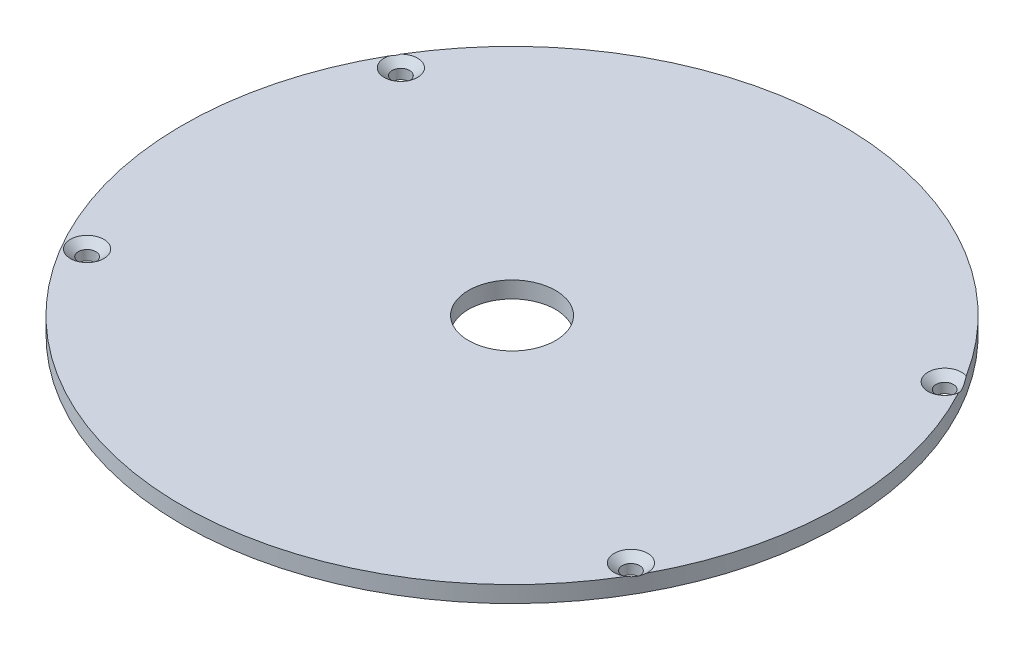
ISO-10303-21;
HEADER;
FILE_DESCRIPTION(('STEP AP214'),'2;1');
FILE_NAME('part.step','',(''),(''),'','','');
FILE_SCHEMA(('AUTOMOTIVE_DESIGN { 1 0 10303 214 1 1 1 1 }'));
ENDSEC;
DATA;
#1=APPLICATION_CONTEXT('core data for automotive mechanical design processes');
#2=APPLICATION_PROTOCOL_DEFINITION('international standard','automotive_design',2000,#1);
#3=PRODUCT_CONTEXT('',#1,'mechanical');
#4=PRODUCT('Part','Part','',(#3));
#5=PRODUCT_RELATED_PRODUCT_CATEGORY('part','',(#4));
#6=PRODUCT_DEFINITION_FORMATION('','',#4);
#7=PRODUCT_DEFINITION_CONTEXT('part definition',#1,'design');
#8=PRODUCT_DEFINITION('design','',#6,#7);
#9=PRODUCT_DEFINITION_SHAPE('','',#8);
#10=(LENGTH_UNIT() NAMED_UNIT(*) SI_UNIT(.MILLI.,.METRE.));
#11=(NAMED_UNIT(*) PLANE_ANGLE_UNIT() SI_UNIT($,.RADIAN.));
#12=(NAMED_UNIT(*) SI_UNIT($,.STERADIAN.) SOLID_ANGLE_UNIT());
#13=UNCERTAINTY_MEASURE_WITH_UNIT(LENGTH_MEASURE(1.E-05),#10,'distance_accuracy_value','');
#14=(GEOMETRIC_REPRESENTATION_CONTEXT(3) GLOBAL_UNCERTAINTY_ASSIGNED_CONTEXT((#13)) GLOBAL_UNIT_ASSIGNED_CONTEXT((#10,
#11,#12)) REPRESENTATION_CONTEXT('',''));
#15=CARTESIAN_POINT('',(0.,0.,0.));
#16=DIRECTION('',(0.,0.,1.));
#17=DIRECTION('',(1.,0.,0.));
#18=AXIS2_PLACEMENT_3D('',#15,#16,#17);
#19=CARTESIAN_POINT('',(0.,6.35,0.));
#20=DIRECTION('',(0.,-1.,0.));
#21=DIRECTION('',(0.,0.,-1.));
#22=AXIS2_PLACEMENT_3D('',#19,#20,#21);
#23=CYLINDRICAL_SURFACE('',#22,127.);
#24=CARTESIAN_POINT('',(0.,6.35,0.));
#25=DIRECTION('',(0.,1.,0.));
#26=DIRECTION('',(0.,0.,1.));
#27=AXIS2_PLACEMENT_3D('',#24,#25,#26);
#28=CIRCLE('',#27,127.);
#29=CARTESIAN_POINT('',(107.720673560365,6.35,-67.2700266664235));
#30=VERTEX_POINT('',#29);
#31=CARTESIAN_POINT('',(-108.671576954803,6.35,-65.7228146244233));
#32=VERTEX_POINT('',#31);
#33=EDGE_CURVE('E73',#30,#32,#28,.T.);
#34=ORIENTED_EDGE('',*,*,#33,.F.);
#35=CARTESIAN_POINT('',(107.720467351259,6.3502,-67.2703568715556));
#36=CARTESIAN_POINT('',(107.793697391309,6.27919614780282,-67.1530920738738));
#37=CARTESIAN_POINT('',(107.86720666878,6.20987681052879,-67.03495595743));
#38=CARTESIAN_POINT('',(108.0149114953,6.07531610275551,-66.7966959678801));
#39=CARTESIAN_POINT('',(108.089107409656,6.01007706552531,-66.6765710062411));
#40=CARTESIAN_POINT('',(108.23885018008,5.88394610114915,-66.4332136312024));
#41=CARTESIAN_POINT('',(108.314403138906,5.82309480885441,-66.3099636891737));
#42=CARTESIAN_POINT('',(108.466283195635,5.70731629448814,-66.0612342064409));
#43=CARTESIAN_POINT('',(108.542610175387,5.65238818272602,-65.9357550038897));
#44=CARTESIAN_POINT('',(108.769728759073,5.50019700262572,-65.5608890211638));
#45=CARTESIAN_POINT('',(108.921778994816,5.4128129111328,-65.3080050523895));
#46=CARTESIAN_POINT('',(109.151439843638,5.30898170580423,-64.922919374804));
#47=CARTESIAN_POINT('',(109.22814508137,5.27893610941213,-64.7937893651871));
#48=CARTESIAN_POINT('',(109.381933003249,5.22889555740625,-64.5338324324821));
#49=CARTESIAN_POINT('',(109.459015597,5.20889830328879,-64.4030059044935));
#50=CARTESIAN_POINT('',(109.639582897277,5.17483285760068,-64.0952696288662));
#51=CARTESIAN_POINT('',(109.743099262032,5.16511792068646,-63.9178716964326));
#52=CARTESIAN_POINT('',(109.949281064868,5.16611584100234,-63.5625504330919));
#53=CARTESIAN_POINT('',(110.051946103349,5.17683780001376,-63.3846269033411));
#54=CARTESIAN_POINT('',(110.255598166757,5.21787853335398,-63.0297153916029));
#55=CARTESIAN_POINT('',(110.356581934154,5.24823163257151,-62.8527295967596));
#56=CARTESIAN_POINT('',(110.55601384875,5.32636055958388,-62.5012692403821));
#57=CARTESIAN_POINT('',(110.654461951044,5.37413669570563,-62.3267947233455));
#58=CARTESIAN_POINT('',(110.847861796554,5.4839322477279,-61.9821775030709));
#59=CARTESIAN_POINT('',(110.942832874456,5.54585182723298,-61.8120133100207));
#60=CARTESIAN_POINT('',(111.130016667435,5.68142994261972,-61.4748452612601));
#61=CARTESIAN_POINT('',(111.22222836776,5.7550927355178,-61.3078425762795));
#62=CARTESIAN_POINT('',(111.403761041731,5.91155701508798,-60.9773521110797));
#63=CARTESIAN_POINT('',(111.493089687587,5.99433111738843,-60.8138554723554));
#64=CARTESIAN_POINT('',(111.625231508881,6.12398848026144,-60.5707534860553));
#65=CARTESIAN_POINT('',(111.668940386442,6.16809093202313,-60.4901321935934));
#66=CARTESIAN_POINT('',(111.755791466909,6.25795032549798,-60.3295234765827));
#67=CARTESIAN_POINT('',(111.79893373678,6.30370706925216,-60.249535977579));
#68=CARTESIAN_POINT('',(111.841812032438,6.3502,-60.1698353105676));
#69=B_SPLINE_CURVE_WITH_KNOTS('',3,(#35,#36,#37,#38,#39,#40,#41,#42,#43,#44,#45,#46,#47,#48,#49,
#50,#51,#52,#53,#54,#55,#56,#57,#58,#59,#60,#61,#62,#63,#64,#65,#66,#67,#68),.UNSPECIFIED.,.F.,
.F.,(4,2,2,2,2,2,2,2,2,2,2,2,2,2,2,2,4),(0.,0.466273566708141,0.932811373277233,
1.40322655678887,1.87357098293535,2.79469089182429,3.25391790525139,3.71303982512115,
4.32886642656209,4.94496735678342,5.56214845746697,6.17934048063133,6.79230357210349,
7.40548937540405,8.01688010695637,8.32214951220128,8.62738250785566),.UNSPECIFIED.);
#70=CARTESIAN_POINT('',(111.84162758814,6.35,-60.1701781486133));
#71=VERTEX_POINT('',#70);
#72=EDGE_CURVE('E46',#30,#71,#69,.T.);
#73=ORIENTED_EDGE('',*,*,#72,.T.);
#74=CARTESIAN_POINT('',(111.919864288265,6.35,60.0245281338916));
#75=VERTEX_POINT('',#74);
#76=EDGE_CURVE('E71',#75,#71,#28,.T.);
#77=ORIENTED_EDGE('',*,*,#76,.F.);
#78=CARTESIAN_POINT('',(111.920129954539,6.3502,60.0240327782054));
#79=CARTESIAN_POINT('',(111.860357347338,6.30520660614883,60.135483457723));
#80=CARTESIAN_POINT('',(111.800064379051,6.26235239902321,60.2475057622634));
#81=CARTESIAN_POINT('',(111.678382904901,6.18147231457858,60.472764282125));
#82=CARTESIAN_POINT('',(111.616993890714,6.143448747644,60.5860010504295));
#83=CARTESIAN_POINT('',(111.430853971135,6.03732172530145,60.9280904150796));
#84=CARTESIAN_POINT('',(111.304451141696,5.97740998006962,61.1587232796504));
#85=CARTESIAN_POINT('',(111.114403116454,5.90820430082,61.5028927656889));
#86=CARTESIAN_POINT('',(111.052153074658,5.88876386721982,61.6152246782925));
#87=CARTESIAN_POINT('',(110.926914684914,5.85642143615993,61.8404089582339));
#88=CARTESIAN_POINT('',(110.863926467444,5.84351830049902,61.9532612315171));
#89=CARTESIAN_POINT('',(110.737452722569,5.82456633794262,62.1790421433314));
#90=CARTESIAN_POINT('',(110.673968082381,5.81850726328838,62.2919704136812));
#91=CARTESIAN_POINT('',(110.546591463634,5.81334692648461,62.5177408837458));
#92=CARTESIAN_POINT('',(110.482699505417,5.81424531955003,62.6305830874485));
#93=CARTESIAN_POINT('',(110.310126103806,5.82604796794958,62.9342855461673));
#94=CARTESIAN_POINT('',(110.201214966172,5.84347981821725,63.1247954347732));
#95=CARTESIAN_POINT('',(109.983480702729,5.89723960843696,63.5033996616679));
#96=CARTESIAN_POINT('',(109.874657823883,5.93358935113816,63.6914909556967));
#97=CARTESIAN_POINT('',(109.654395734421,6.02443798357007,64.069984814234));
#98=CARTESIAN_POINT('',(109.542983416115,6.07947742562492,64.2602705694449));
#99=CARTESIAN_POINT('',(109.321627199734,6.20441012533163,64.6361305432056));
#100=CARTESIAN_POINT('',(109.211680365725,6.27426654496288,64.8217151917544));
#101=CARTESIAN_POINT('',(109.102482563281,6.35020000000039,65.0049867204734));
#102=B_SPLINE_CURVE_WITH_KNOTS('',3,(#78,#79,#80,#81,#82,#83,#84,#85,#86,#87,#88,#89,#90,#91,
#92,#93,#94,#95,#96,#97,#98,#99,#100,#101),.UNSPECIFIED.,.F.,.F.,(4,2,2,2,2,2,2,2,2,2,2,4),(0.,
0.402645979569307,0.805483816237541,1.61332352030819,2.00285991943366,2.39232847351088,
2.78121309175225,3.17007843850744,3.82953680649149,4.48975688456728,5.17097895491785,
5.85052681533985),.UNSPECIFIED.);
#103=CARTESIAN_POINT('',(109.102770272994,6.35,65.0045038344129));
#104=VERTEX_POINT('',#103);
#105=EDGE_CURVE('E41',#75,#104,#102,.T.);
#106=ORIENTED_EDGE('',*,*,#105,.T.);
#107=CARTESIAN_POINT('',(-110.227008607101,6.35,-63.0793672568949));
#108=VERTEX_POINT('',#107);
#109=EDGE_CURVE('E80',#108,#104,#28,.T.);
#110=ORIENTED_EDGE('',*,*,#109,.F.);
#111=CARTESIAN_POINT('',(-111.14340315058,6.89410090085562,-61.450337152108));
#112=CARTESIAN_POINT('',(-111.070307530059,6.83625686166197,-61.5825428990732));
#113=CARTESIAN_POINT('',(-110.996477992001,6.78101213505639,-61.7155192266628));
#114=CARTESIAN_POINT('',(-110.84730386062,6.67652914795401,-61.9830517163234));
#115=CARTESIAN_POINT('',(-110.771958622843,6.62729350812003,-62.1176085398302));
#116=CARTESIAN_POINT('',(-110.619287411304,6.53539815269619,-62.3890827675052));
#117=CARTESIAN_POINT('',(-110.54195191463,6.49278206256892,-62.5260097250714));
#118=CARTESIAN_POINT('',(-110.385816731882,6.41539362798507,-62.8012460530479));
#119=CARTESIAN_POINT('',(-110.307017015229,6.3806214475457,-62.9395554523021));
#120=CARTESIAN_POINT('',(-110.115612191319,6.30736538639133,-63.274028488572));
#121=CARTESIAN_POINT('',(-110.002333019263,6.27315643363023,-63.4707709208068));
#122=CARTESIAN_POINT('',(-109.773637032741,6.22395951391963,-63.8654885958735));
#123=CARTESIAN_POINT('',(-109.658219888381,6.20897453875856,-64.0634640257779));
#124=CARTESIAN_POINT('',(-109.426512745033,6.19920451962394,-64.4584404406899));
#125=CARTESIAN_POINT('',(-109.310227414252,6.20434659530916,-64.6554423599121));
#126=CARTESIAN_POINT('',(-109.077307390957,6.23433534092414,-65.0476209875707));
#127=CARTESIAN_POINT('',(-108.960672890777,6.25917264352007,-65.2427985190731));
#128=CARTESIAN_POINT('',(-108.815362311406,6.30151058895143,-65.484502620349));
#129=CARTESIAN_POINT('',(-108.786465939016,6.310494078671,-65.5324954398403));
#130=CARTESIAN_POINT('',(-108.728717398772,6.32954276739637,-65.6282647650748));
#131=CARTESIAN_POINT('',(-108.699865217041,6.33960748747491,-65.676041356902));
#132=CARTESIAN_POINT('',(-108.57760253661,6.38452393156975,-65.8781967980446));
#133=CARTESIAN_POINT('',(-108.484375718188,6.42438977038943,-66.031598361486));
#134=CARTESIAN_POINT('',(-108.298557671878,6.51397932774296,-66.3359195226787));
#135=CARTESIAN_POINT('',(-108.205966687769,6.56370663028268,-66.4868381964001));
#136=CARTESIAN_POINT('',(-108.021418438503,6.67181286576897,-66.7862570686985));
#137=CARTESIAN_POINT('',(-107.929462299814,6.73020436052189,-66.9347534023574));
#138=CARTESIAN_POINT('',(-107.746364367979,6.85436500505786,-67.229093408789));
#139=CARTESIAN_POINT('',(-107.655222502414,6.92013349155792,-67.3749373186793));
#140=CARTESIAN_POINT('',(-107.381749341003,7.12775114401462,-67.8106045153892));
#141=CARTESIAN_POINT('',(-107.200581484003,7.2791734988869,-68.0965999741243));
#142=CARTESIAN_POINT('',(-106.840915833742,7.60006731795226,-68.6595239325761));
#143=CARTESIAN_POINT('',(-106.662416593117,7.76952856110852,-68.9364574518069));
#144=CARTESIAN_POINT('',(-106.4071266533,8.02259457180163,-69.3292412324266));
#145=CARTESIAN_POINT('',(-106.329599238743,8.10087917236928,-69.4480833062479));
#146=CARTESIAN_POINT('',(-106.174835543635,8.25966505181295,-69.6844621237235));
#147=CARTESIAN_POINT('',(-106.097599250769,8.3401662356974,-69.8019989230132));
#148=CARTESIAN_POINT('',(-105.944116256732,8.50230866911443,-70.0347304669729));
#149=CARTESIAN_POINT('',(-105.867867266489,8.58393106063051,-70.1499368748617));
#150=CARTESIAN_POINT('',(-105.71555409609,8.74885430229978,-70.3792622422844));
#151=CARTESIAN_POINT('',(-105.639489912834,8.83215512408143,-70.4933812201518));
#152=CARTESIAN_POINT('',(-105.563493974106,8.91618608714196,-70.607002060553));
#153=B_SPLINE_CURVE_WITH_KNOTS('',3,(#111,#112,#113,#114,#115,#116,#117,#118,#119,#120,#121,
#122,#123,#124,#125,#126,#127,#128,#129,#130,#131,#132,#133,#134,#135,#136,#137,#138,#139,#140,
#141,#142,#143,#144,#145,#146,#147,#148,#149,#150,#151,#152),.UNSPECIFIED.,.F.,.F.,(4,2,2,2,2,2,
2,2,2,2,2,2,2,2,2,2,2,2,2,2,4),(0.,0.485311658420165,0.970834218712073,1.45943196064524,
1.94803991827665,2.63601944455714,3.32410602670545,4.00970334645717,4.69497478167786,
4.86517951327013,5.03530916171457,5.58659653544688,6.13808463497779,6.69038026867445,
7.24262628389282,8.354364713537,9.46547653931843,9.95163209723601,10.4377668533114,
10.9191457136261,11.4005164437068),.UNSPECIFIED.);
#154=EDGE_CURVE('E82',#108,#32,#153,.T.);
#155=ORIENTED_EDGE('',*,*,#154,.T.);
#156=EDGE_LOOP('',(#34,#73,#77,#106,#110,#155));
#157=FACE_BOUND('',#156,.T.);
#158=CARTESIAN_POINT('',(0.,0.,0.));
#159=DIRECTION('',(0.,1.,0.));
#160=DIRECTION('',(0.,0.,1.));
#161=AXIS2_PLACEMENT_3D('',#158,#159,#160);
#162=CIRCLE('',#161,127.);
#163=CARTESIAN_POINT('',(0.,0.,127.));
#164=VERTEX_POINT('',#163);
#165=EDGE_CURVE('E83',#164,#164,#162,.T.);
#166=ORIENTED_EDGE('',*,*,#165,.T.);
#167=EDGE_LOOP('',(#166));
#168=FACE_BOUND('',#167,.T.);
#169=ADVANCED_FACE('F33',(#157,#168),#23,.T.);
#170=CARTESIAN_POINT('',(0.,6.35,0.));
#171=DIRECTION('',(0.,1.,0.));
#172=DIRECTION('',(0.,0.,1.));
#173=AXIS2_PLACEMENT_3D('',#170,#171,#172);
#174=PLANE('',#173);
#175=CARTESIAN_POINT('',(105.490495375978,6.35,-61.2296840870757));
#176=DIRECTION('',(0.,1.,0.));
#177=DIRECTION('',(0.,0.,1.));
#178=AXIS2_PLACEMENT_3D('',#175,#176,#177);
#179=CIRCLE('',#178,6.4389);
#180=EDGE_CURVE('E11',#30,#71,#179,.T.);
#181=ORIENTED_EDGE('',*,*,#180,.F.);
#182=ORIENTED_EDGE('',*,*,#33,.T.);
#183=CARTESIAN_POINT('',(-104.059504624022,6.35,-61.2296840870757));
#184=DIRECTION('',(0.,1.,0.));
#185=DIRECTION('',(0.,0.,1.));
#186=AXIS2_PLACEMENT_3D('',#183,#184,#185);
#187=CIRCLE('',#186,6.4389);
#188=EDGE_CURVE('E234',#108,#32,#187,.T.);
#189=ORIENTED_EDGE('',*,*,#188,.F.);
#190=ORIENTED_EDGE('',*,*,#109,.T.);
#191=CARTESIAN_POINT('',(105.490495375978,6.35,59.6743159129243));
#192=DIRECTION('',(0.,1.,0.));
#193=DIRECTION('',(0.,0.,1.));
#194=AXIS2_PLACEMENT_3D('',#191,#192,#193);
#195=CIRCLE('',#194,6.4389);
#196=EDGE_CURVE('E53',#75,#104,#195,.T.);
#197=ORIENTED_EDGE('',*,*,#196,.F.);
#198=ORIENTED_EDGE('',*,*,#76,.T.);
#199=EDGE_LOOP('',(#181,#182,#189,#190,#197,#198));
#200=FACE_BOUND('',#199,.T.);
#201=CARTESIAN_POINT('',(-104.059504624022,6.35,59.6743159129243));
#202=DIRECTION('',(0.,1.,0.));
#203=DIRECTION('',(0.,0.,1.));
#204=AXIS2_PLACEMENT_3D('',#201,#202,#203);
#205=CIRCLE('',#204,6.4389);
#206=CARTESIAN_POINT('',(-104.059504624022,6.35,66.1132159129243));
#207=VERTEX_POINT('',#206);
#208=EDGE_CURVE('E225',#207,#207,#205,.T.);
#209=ORIENTED_EDGE('',*,*,#208,.F.);
#210=EDGE_LOOP('',(#209));
#211=FACE_BOUND('',#210,.T.);
#212=CARTESIAN_POINT('',(0.,6.35,0.));
#213=DIRECTION('',(0.,1.,0.));
#214=DIRECTION('',(0.,0.,1.));
#215=AXIS2_PLACEMENT_3D('',#212,#213,#214);
#216=CIRCLE('',#215,16.764);
#217=CARTESIAN_POINT('',(0.,6.35,16.764));
#218=VERTEX_POINT('',#217);
#219=EDGE_CURVE('E237',#218,#218,#216,.T.);
#220=ORIENTED_EDGE('',*,*,#219,.F.);
#221=EDGE_LOOP('',(#220));
#222=FACE_BOUND('',#221,.T.);
#223=ADVANCED_FACE('F77',(#200,#211,#222),#174,.T.);
#224=CARTESIAN_POINT('',(0.,0.,0.));
#225=DIRECTION('',(0.,1.,0.));
#226=DIRECTION('',(0.,0.,1.));
#227=AXIS2_PLACEMENT_3D('',#224,#225,#226);
#228=PLANE('',#227);
#229=CARTESIAN_POINT('',(105.490495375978,0.,-61.2296840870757));
#230=DIRECTION('',(0.,1.,0.));
#231=DIRECTION('',(0.,0.,1.));
#232=AXIS2_PLACEMENT_3D('',#229,#230,#231);
#233=CIRCLE('',#232,3.3782);
#234=CARTESIAN_POINT('',(105.490495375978,0.,-57.8514840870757));
#235=VERTEX_POINT('',#234);
#236=EDGE_CURVE('E267',#235,#235,#233,.T.);
#237=ORIENTED_EDGE('',*,*,#236,.T.);
#238=EDGE_LOOP('',(#237));
#239=FACE_BOUND('',#238,.T.);
#240=CARTESIAN_POINT('',(105.490495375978,0.,59.6743159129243));
#241=DIRECTION('',(0.,1.,0.));
#242=DIRECTION('',(0.,0.,1.));
#243=AXIS2_PLACEMENT_3D('',#240,#241,#242);
#244=CIRCLE('',#243,3.3782);
#245=CARTESIAN_POINT('',(105.490495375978,0.,63.0525159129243));
#246=VERTEX_POINT('',#245);
#247=EDGE_CURVE('E74',#246,#246,#244,.T.);
#248=ORIENTED_EDGE('',*,*,#247,.T.);
#249=EDGE_LOOP('',(#248));
#250=FACE_BOUND('',#249,.T.);
#251=CARTESIAN_POINT('',(-104.059504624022,0.,59.6743159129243));
#252=DIRECTION('',(0.,1.,0.));
#253=DIRECTION('',(0.,0.,1.));
#254=AXIS2_PLACEMENT_3D('',#251,#252,#253);
#255=CIRCLE('',#254,3.3782);
#256=CARTESIAN_POINT('',(-104.059504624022,0.,63.0525159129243));
#257=VERTEX_POINT('',#256);
#258=EDGE_CURVE('E219',#257,#257,#255,.T.);
#259=ORIENTED_EDGE('',*,*,#258,.T.);
#260=EDGE_LOOP('',(#259));
#261=FACE_BOUND('',#260,.T.);
#262=CARTESIAN_POINT('',(-104.059504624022,0.,-61.2296840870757));
#263=DIRECTION('',(0.,1.,0.));
#264=DIRECTION('',(0.,0.,1.));
#265=AXIS2_PLACEMENT_3D('',#262,#263,#264);
#266=CIRCLE('',#265,3.3782);
#267=CARTESIAN_POINT('',(-104.059504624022,0.,-57.8514840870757));
#268=VERTEX_POINT('',#267);
#269=EDGE_CURVE('E228',#268,#268,#266,.T.);
#270=ORIENTED_EDGE('',*,*,#269,.T.);
#271=EDGE_LOOP('',(#270));
#272=FACE_BOUND('',#271,.T.);
#273=CARTESIAN_POINT('',(0.,0.,0.));
#274=DIRECTION('',(0.,1.,0.));
#275=DIRECTION('',(0.,0.,1.));
#276=AXIS2_PLACEMENT_3D('',#273,#274,#275);
#277=CIRCLE('',#276,16.764);
#278=CARTESIAN_POINT('',(0.,0.,16.764));
#279=VERTEX_POINT('',#278);
#280=EDGE_CURVE('E239',#279,#279,#277,.T.);
#281=ORIENTED_EDGE('',*,*,#280,.T.);
#282=EDGE_LOOP('',(#281));
#283=FACE_BOUND('',#282,.T.);
#284=ORIENTED_EDGE('',*,*,#165,.F.);
#285=EDGE_LOOP('',(#284));
#286=FACE_BOUND('',#285,.T.);
#287=ADVANCED_FACE('F106',(#239,#250,#261,#272,#283,#286),#228,.F.);
#288=CARTESIAN_POINT('',(0.,0.,0.));
#289=DIRECTION('',(0.,1.,0.));
#290=DIRECTION('',(0.,0.,1.));
#291=AXIS2_PLACEMENT_3D('',#288,#289,#290);
#292=CYLINDRICAL_SURFACE('',#291,16.764);
#293=ORIENTED_EDGE('',*,*,#280,.F.);
#294=EDGE_LOOP('',(#293));
#295=FACE_BOUND('',#294,.T.);
#296=ORIENTED_EDGE('',*,*,#219,.T.);
#297=EDGE_LOOP('',(#296));
#298=FACE_BOUND('',#297,.T.);
#299=ADVANCED_FACE('F101',(#295,#298),#292,.F.);
#300=CARTESIAN_POINT('',(-104.059504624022,6.35,-61.2296840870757));
#301=DIRECTION('',(0.,1.,0.));
#302=DIRECTION('',(0.,0.,1.));
#303=AXIS2_PLACEMENT_3D('',#300,#301,#302);
#304=CONICAL_SURFACE('',#303,6.4389,0.872664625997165);
#305=CARTESIAN_POINT('',(-104.059504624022,3.7817677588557,-61.2296840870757));
#306=DIRECTION('',(0.,1.,0.));
#307=DIRECTION('',(0.,0.,1.));
#308=AXIS2_PLACEMENT_3D('',#305,#306,#307);
#309=CIRCLE('',#308,3.3782);
#310=CARTESIAN_POINT('',(-104.059504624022,3.7817677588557,-57.8514840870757));
#311=VERTEX_POINT('',#310);
#312=EDGE_CURVE('E231',#311,#311,#309,.T.);
#313=ORIENTED_EDGE('',*,*,#312,.F.);
#314=EDGE_LOOP('',(#313));
#315=FACE_BOUND('',#314,.T.);
#316=ORIENTED_EDGE('',*,*,#188,.T.);
#317=ORIENTED_EDGE('',*,*,#154,.F.);
#318=EDGE_LOOP('',(#316,#317));
#319=FACE_BOUND('',#318,.T.);
#320=ADVANCED_FACE('F95',(#315,#319),#304,.F.);
#321=CARTESIAN_POINT('',(-104.059504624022,6.35,-61.2296840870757));
#322=DIRECTION('',(0.,1.,0.));
#323=DIRECTION('',(0.,0.,1.));
#324=AXIS2_PLACEMENT_3D('',#321,#322,#323);
#325=CYLINDRICAL_SURFACE('',#324,3.3782);
#326=ORIENTED_EDGE('',*,*,#269,.F.);
#327=EDGE_LOOP('',(#326));
#328=FACE_BOUND('',#327,.T.);
#329=ORIENTED_EDGE('',*,*,#312,.T.);
#330=EDGE_LOOP('',(#329));
#331=FACE_BOUND('',#330,.T.);
#332=ADVANCED_FACE('F100',(#328,#331),#325,.F.);
#333=CARTESIAN_POINT('',(-104.059504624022,6.35,59.6743159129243));
#334=DIRECTION('',(0.,1.,0.));
#335=DIRECTION('',(0.,0.,1.));
#336=AXIS2_PLACEMENT_3D('',#333,#334,#335);
#337=CONICAL_SURFACE('',#336,6.4389,0.872664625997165);
#338=CARTESIAN_POINT('',(-104.059504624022,3.7817677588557,59.6743159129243));
#339=DIRECTION('',(0.,1.,0.));
#340=DIRECTION('',(0.,0.,1.));
#341=AXIS2_PLACEMENT_3D('',#338,#339,#340);
#342=CIRCLE('',#341,3.3782);
#343=CARTESIAN_POINT('',(-104.059504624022,3.7817677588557,63.0525159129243));
#344=VERTEX_POINT('',#343);
#345=EDGE_CURVE('E222',#344,#344,#342,.T.);
#346=ORIENTED_EDGE('',*,*,#345,.F.);
#347=EDGE_LOOP('',(#346));
#348=FACE_BOUND('',#347,.T.);
#349=ORIENTED_EDGE('',*,*,#208,.T.);
#350=EDGE_LOOP('',(#349));
#351=FACE_BOUND('',#350,.T.);
#352=ADVANCED_FACE('F144',(#348,#351),#337,.F.);
#353=CARTESIAN_POINT('',(-104.059504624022,6.35,59.6743159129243));
#354=DIRECTION('',(0.,1.,0.));
#355=DIRECTION('',(0.,0.,1.));
#356=AXIS2_PLACEMENT_3D('',#353,#354,#355);
#357=CYLINDRICAL_SURFACE('',#356,3.3782);
#358=ORIENTED_EDGE('',*,*,#258,.F.);
#359=EDGE_LOOP('',(#358));
#360=FACE_BOUND('',#359,.T.);
#361=ORIENTED_EDGE('',*,*,#345,.T.);
#362=EDGE_LOOP('',(#361));
#363=FACE_BOUND('',#362,.T.);
#364=ADVANCED_FACE('F153',(#360,#363),#357,.F.);
#365=CARTESIAN_POINT('',(105.490495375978,6.35,59.6743159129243));
#366=DIRECTION('',(0.,1.,0.));
#367=DIRECTION('',(0.,0.,1.));
#368=AXIS2_PLACEMENT_3D('',#365,#366,#367);
#369=CONICAL_SURFACE('',#368,6.4389,0.872664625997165);
#370=CARTESIAN_POINT('',(105.490495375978,3.7817677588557,59.6743159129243));
#371=DIRECTION('',(0.,1.,0.));
#372=DIRECTION('',(0.,0.,1.));
#373=AXIS2_PLACEMENT_3D('',#370,#371,#372);
#374=CIRCLE('',#373,3.3782);
#375=CARTESIAN_POINT('',(105.490495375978,3.7817677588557,63.0525159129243));
#376=VERTEX_POINT('',#375);
#377=EDGE_CURVE('E215',#376,#376,#374,.T.);
#378=ORIENTED_EDGE('',*,*,#377,.F.);
#379=EDGE_LOOP('',(#378));
#380=FACE_BOUND('',#379,.T.);
#381=ORIENTED_EDGE('',*,*,#196,.T.);
#382=ORIENTED_EDGE('',*,*,#105,.F.);
#383=EDGE_LOOP('',(#381,#382));
#384=FACE_BOUND('',#383,.T.);
#385=ADVANCED_FACE('F162',(#380,#384),#369,.F.);
#386=CARTESIAN_POINT('',(105.490495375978,6.35,59.6743159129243));
#387=DIRECTION('',(0.,1.,0.));
#388=DIRECTION('',(0.,0.,1.));
#389=AXIS2_PLACEMENT_3D('',#386,#387,#388);
#390=CYLINDRICAL_SURFACE('',#389,3.3782);
#391=ORIENTED_EDGE('',*,*,#247,.F.);
#392=EDGE_LOOP('',(#391));
#393=FACE_BOUND('',#392,.T.);
#394=ORIENTED_EDGE('',*,*,#377,.T.);
#395=EDGE_LOOP('',(#394));
#396=FACE_BOUND('',#395,.T.);
#397=ADVANCED_FACE('F172',(#393,#396),#390,.F.);
#398=CARTESIAN_POINT('',(105.490495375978,6.35,-61.2296840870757));
#399=DIRECTION('',(0.,1.,0.));
#400=DIRECTION('',(0.,0.,1.));
#401=AXIS2_PLACEMENT_3D('',#398,#399,#400);
#402=CONICAL_SURFACE('',#401,6.4389,0.872664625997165);
#403=CARTESIAN_POINT('',(105.490495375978,3.7817677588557,-61.2296840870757));
#404=DIRECTION('',(0.,1.,0.));
#405=DIRECTION('',(0.,0.,1.));
#406=AXIS2_PLACEMENT_3D('',#403,#404,#405);
#407=CIRCLE('',#406,3.3782);
#408=CARTESIAN_POINT('',(105.490495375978,3.7817677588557,-57.8514840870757));
#409=VERTEX_POINT('',#408);
#410=EDGE_CURVE('E75',#409,#409,#407,.T.);
#411=ORIENTED_EDGE('',*,*,#410,.F.);
#412=EDGE_LOOP('',(#411));
#413=FACE_BOUND('',#412,.T.);
#414=ORIENTED_EDGE('',*,*,#180,.T.);
#415=ORIENTED_EDGE('',*,*,#72,.F.);
#416=EDGE_LOOP('',(#414,#415));
#417=FACE_BOUND('',#416,.T.);
#418=ADVANCED_FACE('F64',(#413,#417),#402,.F.);
#419=CARTESIAN_POINT('',(105.490495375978,6.35,-61.2296840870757));
#420=DIRECTION('',(0.,1.,0.));
#421=DIRECTION('',(0.,0.,1.));
#422=AXIS2_PLACEMENT_3D('',#419,#420,#421);
#423=CYLINDRICAL_SURFACE('',#422,3.3782);
#424=ORIENTED_EDGE('',*,*,#236,.F.);
#425=EDGE_LOOP('',(#424));
#426=FACE_BOUND('',#425,.T.);
#427=ORIENTED_EDGE('',*,*,#410,.T.);
#428=EDGE_LOOP('',(#427));
#429=FACE_BOUND('',#428,.T.);
#430=ADVANCED_FACE('F190',(#426,#429),#423,.F.);
#431=CLOSED_SHELL('',(#169,#223,#287,#299,#320,#332,#352,#364,#385,#397,#418,#430));
#432=MANIFOLD_SOLID_BREP('B2',#431);
#433=ADVANCED_BREP_SHAPE_REPRESENTATION('',(#18,#432),#14);
#434=SHAPE_DEFINITION_REPRESENTATION(#9,#433);
ENDSEC;
END-ISO-10303-21;
